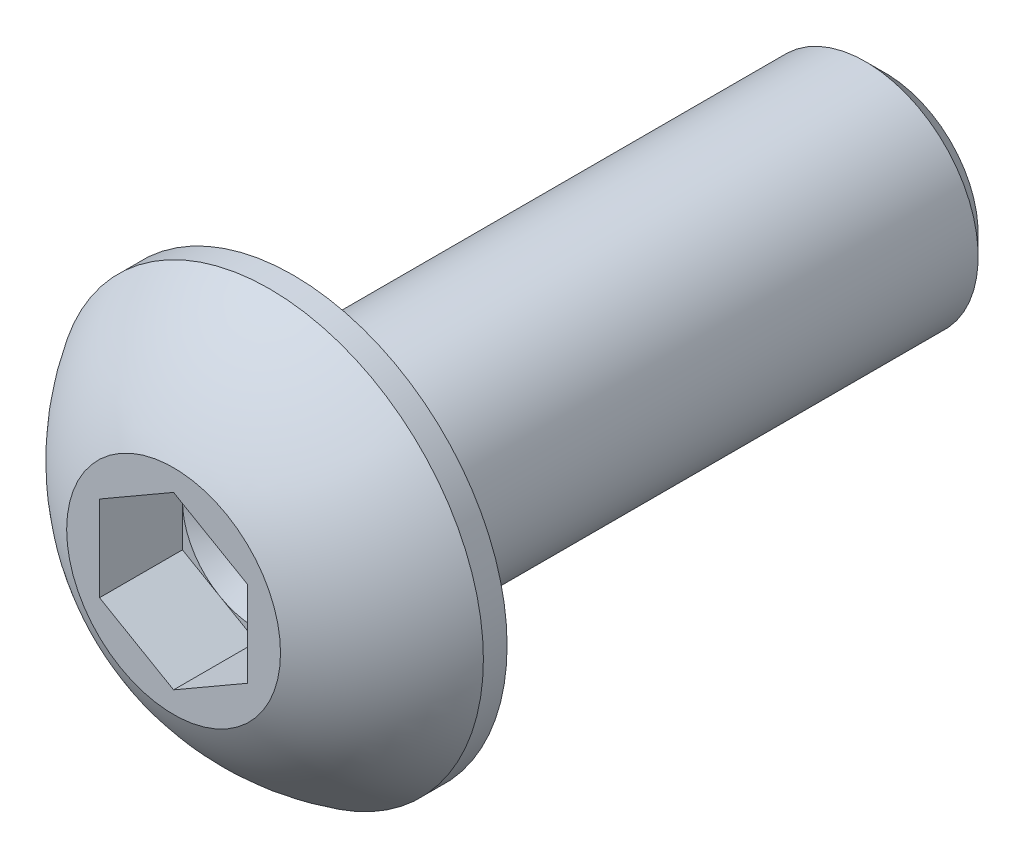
ISO-10303-21;
HEADER;
FILE_DESCRIPTION(('STEP AP214'),'2;1');
FILE_NAME('part.step','',(''),(''),'','','');
FILE_SCHEMA(('AUTOMOTIVE_DESIGN { 1 0 10303 214 1 1 1 1 }'));
ENDSEC;
DATA;
#1=APPLICATION_CONTEXT('core data for automotive mechanical design processes');
#2=APPLICATION_PROTOCOL_DEFINITION('international standard','automotive_design',2000,#1);
#3=PRODUCT_CONTEXT('',#1,'mechanical');
#4=PRODUCT('Part','Part','',(#3));
#5=PRODUCT_RELATED_PRODUCT_CATEGORY('part','',(#4));
#6=PRODUCT_DEFINITION_FORMATION('','',#4);
#7=PRODUCT_DEFINITION_CONTEXT('part definition',#1,'design');
#8=PRODUCT_DEFINITION('design','',#6,#7);
#9=PRODUCT_DEFINITION_SHAPE('','',#8);
#10=(LENGTH_UNIT() NAMED_UNIT(*) SI_UNIT(.MILLI.,.METRE.));
#11=(NAMED_UNIT(*) PLANE_ANGLE_UNIT() SI_UNIT($,.RADIAN.));
#12=(NAMED_UNIT(*) SI_UNIT($,.STERADIAN.) SOLID_ANGLE_UNIT());
#13=UNCERTAINTY_MEASURE_WITH_UNIT(LENGTH_MEASURE(1.E-05),#10,'distance_accuracy_value','');
#14=(GEOMETRIC_REPRESENTATION_CONTEXT(3) GLOBAL_UNCERTAINTY_ASSIGNED_CONTEXT((#13)) GLOBAL_UNIT_ASSIGNED_CONTEXT((#10,
#11,#12)) REPRESENTATION_CONTEXT('',''));
#15=CARTESIAN_POINT('',(0.,0.,0.));
#16=DIRECTION('',(0.,0.,1.));
#17=DIRECTION('',(1.,0.,0.));
#18=AXIS2_PLACEMENT_3D('',#15,#16,#17);
#19=CARTESIAN_POINT('',(0.,0.,-15.2654));
#20=DIRECTION('',(0.,0.,1.));
#21=DIRECTION('',(1.,0.,0.));
#22=AXIS2_PLACEMENT_3D('',#19,#20,#21);
#23=CONICAL_SURFACE('',#22,1.98405761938,0.785398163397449);
#24=CARTESIAN_POINT('',(0.,0.,-15.2654));
#25=DIRECTION('',(0.,0.,-1.));
#26=DIRECTION('',(-1.,0.,0.));
#27=AXIS2_PLACEMENT_3D('',#24,#25,#26);
#28=CIRCLE('',#27,1.98405761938);
#29=CARTESIAN_POINT('',(-1.98405761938,0.,-15.2654));
#30=VERTEX_POINT('',#29);
#31=EDGE_CURVE('E188',#30,#30,#28,.T.);
#32=ORIENTED_EDGE('',*,*,#31,.F.);
#33=EDGE_LOOP('',(#32));
#34=FACE_BOUND('',#33,.T.);
#35=CARTESIAN_POINT('',(0.,0.,-14.83645761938));
#36=DIRECTION('',(0.,0.,1.));
#37=DIRECTION('',(-1.,0.,0.));
#38=AXIS2_PLACEMENT_3D('',#35,#36,#37);
#39=CIRCLE('',#38,2.413);
#40=CARTESIAN_POINT('',(-2.413,0.,-14.83645761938));
#41=VERTEX_POINT('',#40);
#42=EDGE_CURVE('E192',#41,#41,#39,.T.);
#43=ORIENTED_EDGE('',*,*,#42,.F.);
#44=EDGE_LOOP('',(#43));
#45=FACE_BOUND('',#44,.T.);
#46=ADVANCED_FACE('F17',(#34,#45),#23,.T.);
#47=CARTESIAN_POINT('',(0.,0.,-1.778));
#48=DIRECTION('',(0.,0.,1.));
#49=DIRECTION('',(1.,0.,0.));
#50=AXIS2_PLACEMENT_3D('',#47,#48,#49);
#51=CONICAL_SURFACE('',#50,1.5875,1.0471975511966);
#52=CARTESIAN_POINT('',(0.,0.,-1.778));
#53=DIRECTION('',(0.,0.,1.));
#54=DIRECTION('',(1.,0.,0.));
#55=AXIS2_PLACEMENT_3D('',#52,#53,#54);
#56=CIRCLE('',#55,1.5875);
#57=CARTESIAN_POINT('',(1.5875,0.,-1.778));
#58=VERTEX_POINT('',#57);
#59=CARTESIAN_POINT('',(0.79375,1.3748153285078,-1.778));
#60=VERTEX_POINT('',#59);
#61=EDGE_CURVE('E170',#58,#60,#56,.T.);
#62=ORIENTED_EDGE('',*,*,#61,.T.);
#63=CARTESIAN_POINT('',(0.,0.,-1.778));
#64=DIRECTION('',(0.,0.,1.));
#65=DIRECTION('',(1.,0.,0.));
#66=AXIS2_PLACEMENT_3D('',#63,#64,#65);
#67=CIRCLE('',#66,1.5875);
#68=CARTESIAN_POINT('',(-0.79375,1.37481532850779,-1.778));
#69=VERTEX_POINT('',#68);
#70=EDGE_CURVE('E161',#60,#69,#67,.T.);
#71=ORIENTED_EDGE('',*,*,#70,.T.);
#72=CARTESIAN_POINT('',(0.,0.,-1.778));
#73=DIRECTION('',(0.,0.,1.));
#74=DIRECTION('',(1.,0.,0.));
#75=AXIS2_PLACEMENT_3D('',#72,#73,#74);
#76=CIRCLE('',#75,1.5875);
#77=CARTESIAN_POINT('',(-1.5875,0.,-1.778));
#78=VERTEX_POINT('',#77);
#79=EDGE_CURVE('E149',#69,#78,#76,.T.);
#80=ORIENTED_EDGE('',*,*,#79,.T.);
#81=CARTESIAN_POINT('',(0.,0.,-1.778));
#82=DIRECTION('',(0.,0.,1.));
#83=DIRECTION('',(1.,0.,0.));
#84=AXIS2_PLACEMENT_3D('',#81,#82,#83);
#85=CIRCLE('',#84,1.5875);
#86=CARTESIAN_POINT('',(-0.79375,-1.3748153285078,-1.778));
#87=VERTEX_POINT('',#86);
#88=EDGE_CURVE('E193',#78,#87,#85,.T.);
#89=ORIENTED_EDGE('',*,*,#88,.T.);
#90=CARTESIAN_POINT('',(0.,0.,-1.778));
#91=DIRECTION('',(0.,0.,1.));
#92=DIRECTION('',(1.,0.,0.));
#93=AXIS2_PLACEMENT_3D('',#90,#91,#92);
#94=CIRCLE('',#93,1.5875);
#95=CARTESIAN_POINT('',(0.79375,-1.37481532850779,-1.778));
#96=VERTEX_POINT('',#95);
#97=EDGE_CURVE('E214',#87,#96,#94,.T.);
#98=ORIENTED_EDGE('',*,*,#97,.T.);
#99=CARTESIAN_POINT('',(0.,0.,-1.778));
#100=DIRECTION('',(0.,0.,1.));
#101=DIRECTION('',(1.,0.,0.));
#102=AXIS2_PLACEMENT_3D('',#99,#100,#101);
#103=CIRCLE('',#102,1.5875);
#104=EDGE_CURVE('E11',#96,#58,#103,.T.);
#105=ORIENTED_EDGE('',*,*,#104,.T.);
#106=EDGE_LOOP('',(#62,#71,#80,#89,#98,#105));
#107=FACE_BOUND('',#106,.T.);
#108=CARTESIAN_POINT('',(0.,0.,-2.69454355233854));
#109=VERTEX_POINT('',#108);
#110=VERTEX_LOOP('',#109);
#111=FACE_BOUND('',#110,.T.);
#112=ADVANCED_FACE('F167',(#107,#111),#51,.F.);
#113=CARTESIAN_POINT('',(0.,0.,-1.778));
#114=DIRECTION('',(0.,0.,1.));
#115=DIRECTION('',(1.,0.,0.));
#116=AXIS2_PLACEMENT_3D('',#113,#114,#115);
#117=PLANE('',#116);
#118=ORIENTED_EDGE('',*,*,#104,.F.);
#119=DIRECTION('',(-0.866025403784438,-0.5,0.));
#120=VECTOR('',#119,1.);
#121=CARTESIAN_POINT('',(0.79375,-1.37481532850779,-1.778));
#122=LINE('',#121,#120);
#123=CARTESIAN_POINT('',(1.5875,-0.916543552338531,-1.778));
#124=VERTEX_POINT('',#123);
#125=EDGE_CURVE('E267',#124,#96,#122,.T.);
#126=ORIENTED_EDGE('',*,*,#125,.F.);
#127=DIRECTION('',(0.,-1.,0.));
#128=VECTOR('',#127,1.);
#129=CARTESIAN_POINT('',(1.5875,0.,-1.778));
#130=LINE('',#129,#128);
#131=EDGE_CURVE('E26',#58,#124,#130,.T.);
#132=ORIENTED_EDGE('',*,*,#131,.F.);
#133=EDGE_LOOP('',(#118,#126,#132));
#134=FACE_BOUND('',#133,.T.);
#135=ADVANCED_FACE('F319',(#134),#117,.T.);
#136=CARTESIAN_POINT('',(1.5875,0.,-1.778));
#137=DIRECTION('',(-1.,0.,0.));
#138=DIRECTION('',(0.,0.,1.));
#139=AXIS2_PLACEMENT_3D('',#136,#137,#138);
#140=PLANE('',#139);
#141=DIRECTION('',(0.,-1.,0.));
#142=VECTOR('',#141,1.);
#143=CARTESIAN_POINT('',(1.5875,0.,0.));
#144=LINE('',#143,#142);
#145=CARTESIAN_POINT('',(1.5875,0.916543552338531,0.));
#146=VERTEX_POINT('',#145);
#147=CARTESIAN_POINT('',(1.5875,-0.916543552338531,0.));
#148=VERTEX_POINT('',#147);
#149=EDGE_CURVE('E227',#146,#148,#144,.T.);
#150=ORIENTED_EDGE('',*,*,#149,.F.);
#151=DIRECTION('',(0.,0.,1.));
#152=VECTOR('',#151,1.);
#153=CARTESIAN_POINT('',(1.5875,0.916543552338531,-1.778));
#154=LINE('',#153,#152);
#155=CARTESIAN_POINT('',(1.5875,0.916543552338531,-1.778));
#156=VERTEX_POINT('',#155);
#157=EDGE_CURVE('E241',#156,#146,#154,.T.);
#158=ORIENTED_EDGE('',*,*,#157,.F.);
#159=DIRECTION('',(0.,-1.,0.));
#160=VECTOR('',#159,1.);
#161=CARTESIAN_POINT('',(1.5875,0.,-1.778));
#162=LINE('',#161,#160);
#163=EDGE_CURVE('E179',#156,#58,#162,.T.);
#164=ORIENTED_EDGE('',*,*,#163,.T.);
#165=ORIENTED_EDGE('',*,*,#131,.T.);
#166=DIRECTION('',(0.,0.,1.));
#167=VECTOR('',#166,1.);
#168=CARTESIAN_POINT('',(1.5875,-0.916543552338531,-1.778));
#169=LINE('',#168,#167);
#170=EDGE_CURVE('E264',#124,#148,#169,.T.);
#171=ORIENTED_EDGE('',*,*,#170,.T.);
#172=EDGE_LOOP('',(#150,#158,#164,#165,#171));
#173=FACE_BOUND('',#172,.T.);
#174=ADVANCED_FACE('F412',(#173),#140,.T.);
#175=CARTESIAN_POINT('',(0.79375,-1.37481532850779,-1.778));
#176=DIRECTION('',(-0.5,0.866025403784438,0.));
#177=DIRECTION('',(0.,0.,1.));
#178=AXIS2_PLACEMENT_3D('',#175,#176,#177);
#179=PLANE('',#178);
#180=DIRECTION('',(-0.866025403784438,-0.5,0.));
#181=VECTOR('',#180,1.);
#182=CARTESIAN_POINT('',(0.79375,-1.37481532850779,0.));
#183=LINE('',#182,#181);
#184=CARTESIAN_POINT('',(0.,-1.83308710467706,0.));
#185=VERTEX_POINT('',#184);
#186=EDGE_CURVE('E204',#148,#185,#183,.T.);
#187=ORIENTED_EDGE('',*,*,#186,.F.);
#188=ORIENTED_EDGE('',*,*,#170,.F.);
#189=ORIENTED_EDGE('',*,*,#125,.T.);
#190=DIRECTION('',(-0.866025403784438,-0.5,0.));
#191=VECTOR('',#190,1.);
#192=CARTESIAN_POINT('',(0.79375,-1.37481532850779,-1.778));
#193=LINE('',#192,#191);
#194=CARTESIAN_POINT('',(0.,-1.83308710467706,-1.778));
#195=VERTEX_POINT('',#194);
#196=EDGE_CURVE('E182',#96,#195,#193,.T.);
#197=ORIENTED_EDGE('',*,*,#196,.T.);
#198=DIRECTION('',(0.,0.,1.));
#199=VECTOR('',#198,1.);
#200=CARTESIAN_POINT('',(0.,-1.83308710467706,-1.778));
#201=LINE('',#200,#199);
#202=EDGE_CURVE('E261',#195,#185,#201,.T.);
#203=ORIENTED_EDGE('',*,*,#202,.T.);
#204=EDGE_LOOP('',(#187,#188,#189,#197,#203));
#205=FACE_BOUND('',#204,.T.);
#206=ADVANCED_FACE('F404',(#205),#179,.T.);
#207=CARTESIAN_POINT('',(-0.79375,-1.3748153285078,-1.778));
#208=DIRECTION('',(0.5,0.866025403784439,0.));
#209=DIRECTION('',(0.,0.,-1.));
#210=AXIS2_PLACEMENT_3D('',#207,#208,#209);
#211=PLANE('',#210);
#212=DIRECTION('',(-0.866025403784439,0.5,0.));
#213=VECTOR('',#212,1.);
#214=CARTESIAN_POINT('',(-0.79375,-1.3748153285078,0.));
#215=LINE('',#214,#213);
#216=CARTESIAN_POINT('',(-1.5875,-0.916543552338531,0.));
#217=VERTEX_POINT('',#216);
#218=EDGE_CURVE('E199',#185,#217,#215,.T.);
#219=ORIENTED_EDGE('',*,*,#218,.F.);
#220=ORIENTED_EDGE('',*,*,#202,.F.);
#221=DIRECTION('',(-0.866025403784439,0.5,0.));
#222=VECTOR('',#221,1.);
#223=CARTESIAN_POINT('',(-0.79375,-1.3748153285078,-1.778));
#224=LINE('',#223,#222);
#225=EDGE_CURVE('E187',#195,#87,#224,.T.);
#226=ORIENTED_EDGE('',*,*,#225,.T.);
#227=DIRECTION('',(-0.866025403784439,0.5,0.));
#228=VECTOR('',#227,1.);
#229=CARTESIAN_POINT('',(-0.79375,-1.3748153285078,-1.778));
#230=LINE('',#229,#228);
#231=CARTESIAN_POINT('',(-1.5875,-0.916543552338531,-1.778));
#232=VERTEX_POINT('',#231);
#233=EDGE_CURVE('E210',#87,#232,#230,.T.);
#234=ORIENTED_EDGE('',*,*,#233,.T.);
#235=DIRECTION('',(0.,0.,1.));
#236=VECTOR('',#235,1.);
#237=CARTESIAN_POINT('',(-1.5875,-0.916543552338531,-1.778));
#238=LINE('',#237,#236);
#239=EDGE_CURVE('E258',#232,#217,#238,.T.);
#240=ORIENTED_EDGE('',*,*,#239,.T.);
#241=EDGE_LOOP('',(#219,#220,#226,#234,#240));
#242=FACE_BOUND('',#241,.T.);
#243=ADVANCED_FACE('F335',(#242),#211,.T.);
#244=CARTESIAN_POINT('',(-1.5875,0.,-1.778));
#245=DIRECTION('',(1.,0.,0.));
#246=DIRECTION('',(0.,1.,0.));
#247=AXIS2_PLACEMENT_3D('',#244,#245,#246);
#248=PLANE('',#247);
#249=DIRECTION('',(0.,1.,0.));
#250=VECTOR('',#249,1.);
#251=CARTESIAN_POINT('',(-1.5875,0.,0.));
#252=LINE('',#251,#250);
#253=CARTESIAN_POINT('',(-1.5875,0.916543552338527,0.));
#254=VERTEX_POINT('',#253);
#255=EDGE_CURVE('E203',#217,#254,#252,.T.);
#256=ORIENTED_EDGE('',*,*,#255,.F.);
#257=ORIENTED_EDGE('',*,*,#239,.F.);
#258=DIRECTION('',(0.,1.,0.));
#259=VECTOR('',#258,1.);
#260=CARTESIAN_POINT('',(-1.5875,0.,-1.778));
#261=LINE('',#260,#259);
#262=EDGE_CURVE('E195',#232,#78,#261,.T.);
#263=ORIENTED_EDGE('',*,*,#262,.T.);
#264=DIRECTION('',(0.,1.,0.));
#265=VECTOR('',#264,1.);
#266=CARTESIAN_POINT('',(-1.5875,0.,-1.778));
#267=LINE('',#266,#265);
#268=CARTESIAN_POINT('',(-1.5875,0.916543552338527,-1.778));
#269=VERTEX_POINT('',#268);
#270=EDGE_CURVE('E148',#78,#269,#267,.T.);
#271=ORIENTED_EDGE('',*,*,#270,.T.);
#272=DIRECTION('',(0.,0.,1.));
#273=VECTOR('',#272,1.);
#274=CARTESIAN_POINT('',(-1.5875,0.916543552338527,-1.778));
#275=LINE('',#274,#273);
#276=EDGE_CURVE('E143',#269,#254,#275,.T.);
#277=ORIENTED_EDGE('',*,*,#276,.T.);
#278=EDGE_LOOP('',(#256,#257,#263,#271,#277));
#279=FACE_BOUND('',#278,.T.);
#280=ADVANCED_FACE('F331',(#279),#248,.T.);
#281=CARTESIAN_POINT('',(-0.79375,1.37481532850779,-1.778));
#282=DIRECTION('',(0.5,-0.866025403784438,0.));
#283=DIRECTION('',(0.,0.,-1.));
#284=AXIS2_PLACEMENT_3D('',#281,#282,#283);
#285=PLANE('',#284);
#286=DIRECTION('',(0.866025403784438,0.5,0.));
#287=VECTOR('',#286,1.);
#288=CARTESIAN_POINT('',(-0.79375,1.37481532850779,0.));
#289=LINE('',#288,#287);
#290=CARTESIAN_POINT('',(0.,1.83308710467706,0.));
#291=VERTEX_POINT('',#290);
#292=EDGE_CURVE('E207',#254,#291,#289,.T.);
#293=ORIENTED_EDGE('',*,*,#292,.F.);
#294=ORIENTED_EDGE('',*,*,#276,.F.);
#295=DIRECTION('',(0.866025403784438,0.5,0.));
#296=VECTOR('',#295,1.);
#297=CARTESIAN_POINT('',(-0.79375,1.37481532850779,-1.778));
#298=LINE('',#297,#296);
#299=EDGE_CURVE('E136',#269,#69,#298,.T.);
#300=ORIENTED_EDGE('',*,*,#299,.T.);
#301=DIRECTION('',(0.866025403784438,0.5,0.));
#302=VECTOR('',#301,1.);
#303=CARTESIAN_POINT('',(-0.79375,1.37481532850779,-1.778));
#304=LINE('',#303,#302);
#305=CARTESIAN_POINT('',(0.,1.83308710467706,-1.778));
#306=VERTEX_POINT('',#305);
#307=EDGE_CURVE('E141',#69,#306,#304,.T.);
#308=ORIENTED_EDGE('',*,*,#307,.T.);
#309=DIRECTION('',(0.,0.,1.));
#310=VECTOR('',#309,1.);
#311=CARTESIAN_POINT('',(0.,1.83308710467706,-1.778));
#312=LINE('',#311,#310);
#313=EDGE_CURVE('E191',#306,#291,#312,.T.);
#314=ORIENTED_EDGE('',*,*,#313,.T.);
#315=EDGE_LOOP('',(#293,#294,#300,#308,#314));
#316=FACE_BOUND('',#315,.T.);
#317=ADVANCED_FACE('F139',(#316),#285,.T.);
#318=CARTESIAN_POINT('',(0.79375,1.3748153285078,-1.778));
#319=DIRECTION('',(-0.5,-0.866025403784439,0.));
#320=DIRECTION('',(-0.866025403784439,0.5,0.));
#321=AXIS2_PLACEMENT_3D('',#318,#319,#320);
#322=PLANE('',#321);
#323=DIRECTION('',(0.866025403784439,-0.5,0.));
#324=VECTOR('',#323,1.);
#325=CARTESIAN_POINT('',(0.79375,1.3748153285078,0.));
#326=LINE('',#325,#324);
#327=EDGE_CURVE('E223',#291,#146,#326,.T.);
#328=ORIENTED_EDGE('',*,*,#327,.F.);
#329=ORIENTED_EDGE('',*,*,#313,.F.);
#330=DIRECTION('',(0.866025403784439,-0.5,0.));
#331=VECTOR('',#330,1.);
#332=CARTESIAN_POINT('',(0.79375,1.3748153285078,-1.778));
#333=LINE('',#332,#331);
#334=EDGE_CURVE('E163',#306,#60,#333,.T.);
#335=ORIENTED_EDGE('',*,*,#334,.T.);
#336=DIRECTION('',(0.866025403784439,-0.5,0.));
#337=VECTOR('',#336,1.);
#338=CARTESIAN_POINT('',(0.79375,1.3748153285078,-1.778));
#339=LINE('',#338,#337);
#340=EDGE_CURVE('E172',#60,#156,#339,.T.);
#341=ORIENTED_EDGE('',*,*,#340,.T.);
#342=ORIENTED_EDGE('',*,*,#157,.T.);
#343=EDGE_LOOP('',(#328,#329,#335,#341,#342));
#344=FACE_BOUND('',#343,.T.);
#345=ADVANCED_FACE('F348',(#344),#322,.T.);
#346=CARTESIAN_POINT('',(0.,0.,-4.85989606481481));
#347=DIRECTION('',(0.,0.,-1.));
#348=DIRECTION('',(-1.,0.,0.));
#349=AXIS2_PLACEMENT_3D('',#346,#347,#348);
#350=SPHERICAL_SURFACE('',#349,5.37340285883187);
#351=CARTESIAN_POINT('',(0.,0.,0.));
#352=DIRECTION('',(0.,0.,-1.));
#353=DIRECTION('',(-1.,0.,0.));
#354=AXIS2_PLACEMENT_3D('',#351,#352,#353);
#355=CIRCLE('',#354,2.29235);
#356=CARTESIAN_POINT('',(-2.29235,0.,0.));
#357=VERTEX_POINT('',#356);
#358=EDGE_CURVE('E186',#357,#357,#355,.T.);
#359=ORIENTED_EDGE('',*,*,#358,.T.);
#360=EDGE_LOOP('',(#359));
#361=FACE_BOUND('',#360,.T.);
#362=CARTESIAN_POINT('',(0.,0.,-2.0574));
#363=DIRECTION('',(0.,0.,-1.));
#364=DIRECTION('',(-1.,0.,0.));
#365=AXIS2_PLACEMENT_3D('',#362,#363,#364);
#366=CIRCLE('',#365,4.5847);
#367=CARTESIAN_POINT('',(-4.5847,0.,-2.0574));
#368=VERTEX_POINT('',#367);
#369=EDGE_CURVE('E237',#368,#368,#366,.T.);
#370=ORIENTED_EDGE('',*,*,#369,.F.);
#371=EDGE_LOOP('',(#370));
#372=FACE_BOUND('',#371,.T.);
#373=ADVANCED_FACE('F352',(#361,#372),#350,.T.);
#374=CARTESIAN_POINT('',(-1.2065,0.,-15.2654));
#375=DIRECTION('',(0.,0.,-1.));
#376=DIRECTION('',(0.,-1.,0.));
#377=AXIS2_PLACEMENT_3D('',#374,#375,#376);
#378=PLANE('',#377);
#379=ORIENTED_EDGE('',*,*,#31,.T.);
#380=EDGE_LOOP('',(#379));
#381=FACE_BOUND('',#380,.T.);
#382=ADVANCED_FACE('F382',(#381),#378,.T.);
#383=CARTESIAN_POINT('',(0.,0.,1.48381805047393));
#384=DIRECTION('',(0.,0.,-1.));
#385=DIRECTION('',(-1.,0.,0.));
#386=AXIS2_PLACEMENT_3D('',#383,#384,#385);
#387=CYLINDRICAL_SURFACE('',#386,2.413);
#388=CARTESIAN_POINT('',(0.,0.,-2.9464));
#389=DIRECTION('',(0.,0.,-1.));
#390=DIRECTION('',(-1.,0.,0.));
#391=AXIS2_PLACEMENT_3D('',#388,#389,#390);
#392=CIRCLE('',#391,2.413);
#393=CARTESIAN_POINT('',(-2.413,0.,-2.9464));
#394=VERTEX_POINT('',#393);
#395=EDGE_CURVE('E249',#394,#394,#392,.T.);
#396=ORIENTED_EDGE('',*,*,#395,.T.);
#397=EDGE_LOOP('',(#396));
#398=FACE_BOUND('',#397,.T.);
#399=ORIENTED_EDGE('',*,*,#42,.T.);
#400=EDGE_LOOP('',(#399));
#401=FACE_BOUND('',#400,.T.);
#402=ADVANCED_FACE('F374',(#398,#401),#387,.T.);
#403=CARTESIAN_POINT('',(0.,0.,-2.9464));
#404=DIRECTION('',(0.,0.,-1.));
#405=DIRECTION('',(-1.,0.,0.));
#406=AXIS2_PLACEMENT_3D('',#403,#404,#405);
#407=TOROIDAL_SURFACE('',#406,2.794,0.381);
#408=ORIENTED_EDGE('',*,*,#395,.F.);
#409=EDGE_LOOP('',(#408));
#410=FACE_BOUND('',#409,.T.);
#411=CARTESIAN_POINT('',(0.,0.,-2.5654));
#412=DIRECTION('',(0.,0.,-1.));
#413=DIRECTION('',(-1.,0.,0.));
#414=AXIS2_PLACEMENT_3D('',#411,#412,#413);
#415=CIRCLE('',#414,2.794);
#416=CARTESIAN_POINT('',(-2.794,0.,-2.5654));
#417=VERTEX_POINT('',#416);
#418=EDGE_CURVE('E246',#417,#417,#415,.T.);
#419=ORIENTED_EDGE('',*,*,#418,.T.);
#420=EDGE_LOOP('',(#419));
#421=FACE_BOUND('',#420,.T.);
#422=ADVANCED_FACE('F366',(#410,#421),#407,.F.);
#423=CARTESIAN_POINT('',(-3.68935,0.,-2.5654));
#424=DIRECTION('',(0.,0.,-1.));
#425=DIRECTION('',(0.,-1.,0.));
#426=AXIS2_PLACEMENT_3D('',#423,#424,#425);
#427=PLANE('',#426);
#428=ORIENTED_EDGE('',*,*,#418,.F.);
#429=EDGE_LOOP('',(#428));
#430=FACE_BOUND('',#429,.T.);
#431=CARTESIAN_POINT('',(0.,0.,-2.5654));
#432=DIRECTION('',(0.,0.,-1.));
#433=DIRECTION('',(-1.,0.,0.));
#434=AXIS2_PLACEMENT_3D('',#431,#432,#433);
#435=CIRCLE('',#434,4.5847);
#436=CARTESIAN_POINT('',(-4.5847,0.,-2.5654));
#437=VERTEX_POINT('',#436);
#438=EDGE_CURVE('E240',#437,#437,#435,.T.);
#439=ORIENTED_EDGE('',*,*,#438,.T.);
#440=EDGE_LOOP('',(#439));
#441=FACE_BOUND('',#440,.T.);
#442=ADVANCED_FACE('F343',(#430,#441),#427,.T.);
#443=CARTESIAN_POINT('',(0.,0.,1.48381805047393));
#444=DIRECTION('',(0.,0.,-1.));
#445=DIRECTION('',(-1.,0.,0.));
#446=AXIS2_PLACEMENT_3D('',#443,#444,#445);
#447=CYLINDRICAL_SURFACE('',#446,4.5847);
#448=ORIENTED_EDGE('',*,*,#438,.F.);
#449=EDGE_LOOP('',(#448));
#450=FACE_BOUND('',#449,.T.);
#451=ORIENTED_EDGE('',*,*,#369,.T.);
#452=EDGE_LOOP('',(#451));
#453=FACE_BOUND('',#452,.T.);
#454=ADVANCED_FACE('F326',(#450,#453),#447,.T.);
#455=CARTESIAN_POINT('',(-1.146175,0.,0.));
#456=DIRECTION('',(0.,0.,1.));
#457=DIRECTION('',(1.,0.,0.));
#458=AXIS2_PLACEMENT_3D('',#455,#456,#457);
#459=PLANE('',#458);
#460=ORIENTED_EDGE('',*,*,#292,.T.);
#461=ORIENTED_EDGE('',*,*,#327,.T.);
#462=ORIENTED_EDGE('',*,*,#149,.T.);
#463=ORIENTED_EDGE('',*,*,#186,.T.);
#464=ORIENTED_EDGE('',*,*,#218,.T.);
#465=ORIENTED_EDGE('',*,*,#255,.T.);
#466=EDGE_LOOP('',(#460,#461,#462,#463,#464,#465));
#467=FACE_BOUND('',#466,.T.);
#468=ORIENTED_EDGE('',*,*,#358,.F.);
#469=EDGE_LOOP('',(#468));
#470=FACE_BOUND('',#469,.T.);
#471=ADVANCED_FACE('F304',(#467,#470),#459,.T.);
#472=CARTESIAN_POINT('',(0.,0.,-1.778));
#473=DIRECTION('',(0.,0.,1.));
#474=DIRECTION('',(1.,0.,0.));
#475=AXIS2_PLACEMENT_3D('',#472,#473,#474);
#476=PLANE('',#475);
#477=ORIENTED_EDGE('',*,*,#97,.F.);
#478=ORIENTED_EDGE('',*,*,#225,.F.);
#479=ORIENTED_EDGE('',*,*,#196,.F.);
#480=EDGE_LOOP('',(#477,#478,#479));
#481=FACE_BOUND('',#480,.T.);
#482=ADVANCED_FACE('F300',(#481),#476,.T.);
#483=CARTESIAN_POINT('',(0.,0.,-1.778));
#484=DIRECTION('',(0.,0.,1.));
#485=DIRECTION('',(1.,0.,0.));
#486=AXIS2_PLACEMENT_3D('',#483,#484,#485);
#487=PLANE('',#486);
#488=ORIENTED_EDGE('',*,*,#88,.F.);
#489=ORIENTED_EDGE('',*,*,#262,.F.);
#490=ORIENTED_EDGE('',*,*,#233,.F.);
#491=EDGE_LOOP('',(#488,#489,#490));
#492=FACE_BOUND('',#491,.T.);
#493=ADVANCED_FACE('F281',(#492),#487,.T.);
#494=CARTESIAN_POINT('',(0.,0.,-1.778));
#495=DIRECTION('',(0.,0.,1.));
#496=DIRECTION('',(1.,0.,0.));
#497=AXIS2_PLACEMENT_3D('',#494,#495,#496);
#498=PLANE('',#497);
#499=ORIENTED_EDGE('',*,*,#79,.F.);
#500=ORIENTED_EDGE('',*,*,#299,.F.);
#501=ORIENTED_EDGE('',*,*,#270,.F.);
#502=EDGE_LOOP('',(#499,#500,#501));
#503=FACE_BOUND('',#502,.T.);
#504=ADVANCED_FACE('F152',(#503),#498,.T.);
#505=CARTESIAN_POINT('',(0.,0.,-1.778));
#506=DIRECTION('',(0.,0.,1.));
#507=DIRECTION('',(1.,0.,0.));
#508=AXIS2_PLACEMENT_3D('',#505,#506,#507);
#509=PLANE('',#508);
#510=ORIENTED_EDGE('',*,*,#70,.F.);
#511=ORIENTED_EDGE('',*,*,#334,.F.);
#512=ORIENTED_EDGE('',*,*,#307,.F.);
#513=EDGE_LOOP('',(#510,#511,#512));
#514=FACE_BOUND('',#513,.T.);
#515=ADVANCED_FACE('F160',(#514),#509,.T.);
#516=CARTESIAN_POINT('',(0.,0.,-1.778));
#517=DIRECTION('',(0.,0.,1.));
#518=DIRECTION('',(1.,0.,0.));
#519=AXIS2_PLACEMENT_3D('',#516,#517,#518);
#520=PLANE('',#519);
#521=ORIENTED_EDGE('',*,*,#61,.F.);
#522=ORIENTED_EDGE('',*,*,#163,.F.);
#523=ORIENTED_EDGE('',*,*,#340,.F.);
#524=EDGE_LOOP('',(#521,#522,#523));
#525=FACE_BOUND('',#524,.T.);
#526=ADVANCED_FACE('F286',(#525),#520,.T.);
#527=CLOSED_SHELL('',(#46,#112,#135,#174,#206,#243,#280,#317,#345,#373,#382,#402,#422,#442,#454,
#471,#482,#493,#504,#515,#526));
#528=MANIFOLD_SOLID_BREP('B1',#527);
#529=ADVANCED_BREP_SHAPE_REPRESENTATION('',(#18,#528),#14);
#530=SHAPE_DEFINITION_REPRESENTATION(#9,#529);
ENDSEC;
END-ISO-10303-21;
